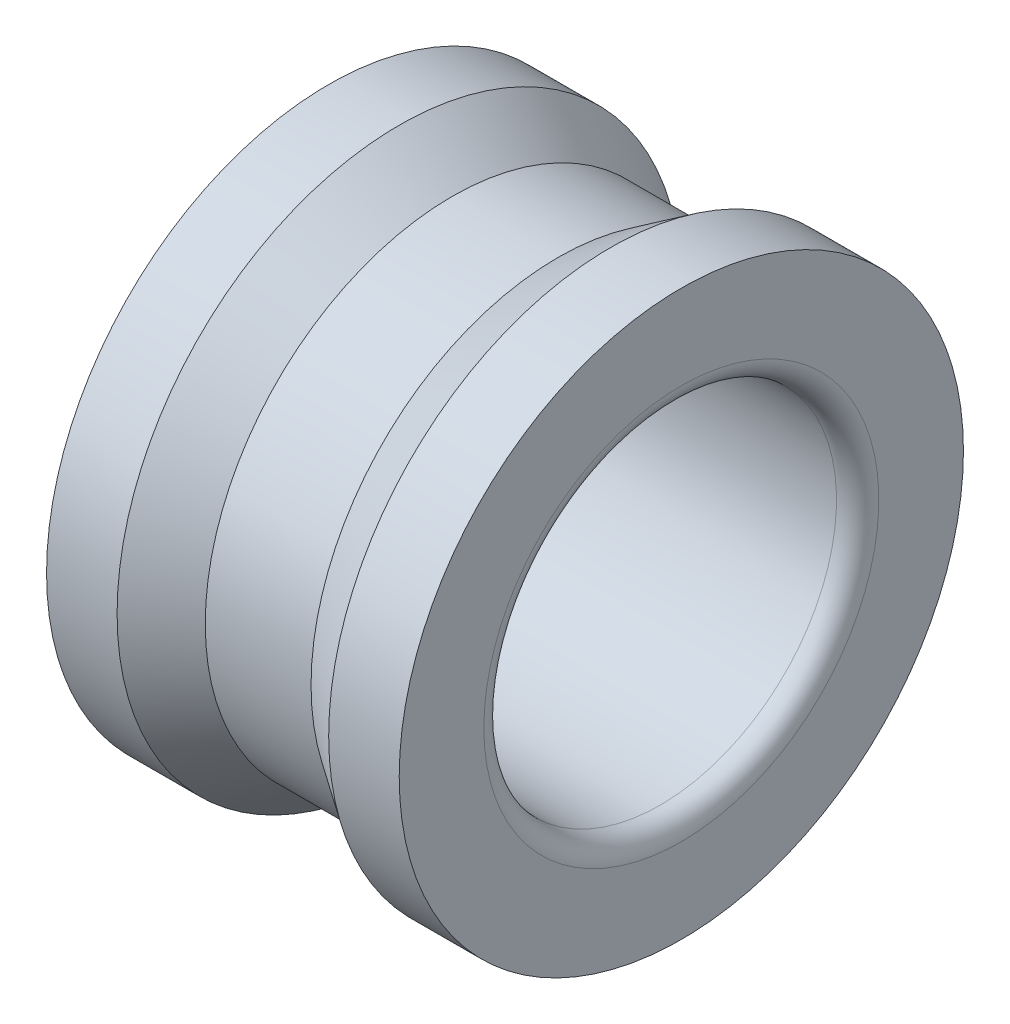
ISO-10303-21;
HEADER;
FILE_DESCRIPTION(('STEP AP214'),'2;1');
FILE_NAME('part.step','',(''),(''),'','','');
FILE_SCHEMA(('AUTOMOTIVE_DESIGN { 1 0 10303 214 1 1 1 1 }'));
ENDSEC;
DATA;
#1=APPLICATION_CONTEXT('core data for automotive mechanical design processes');
#2=APPLICATION_PROTOCOL_DEFINITION('international standard','automotive_design',2000,#1);
#3=PRODUCT_CONTEXT('',#1,'mechanical');
#4=PRODUCT('Part','Part','',(#3));
#5=PRODUCT_RELATED_PRODUCT_CATEGORY('part','',(#4));
#6=PRODUCT_DEFINITION_FORMATION('','',#4);
#7=PRODUCT_DEFINITION_CONTEXT('part definition',#1,'design');
#8=PRODUCT_DEFINITION('design','',#6,#7);
#9=PRODUCT_DEFINITION_SHAPE('','',#8);
#10=(LENGTH_UNIT() NAMED_UNIT(*) SI_UNIT(.MILLI.,.METRE.));
#11=(NAMED_UNIT(*) PLANE_ANGLE_UNIT() SI_UNIT($,.RADIAN.));
#12=(NAMED_UNIT(*) SI_UNIT($,.STERADIAN.) SOLID_ANGLE_UNIT());
#13=UNCERTAINTY_MEASURE_WITH_UNIT(LENGTH_MEASURE(1.E-05),#10,'distance_accuracy_value','');
#14=(GEOMETRIC_REPRESENTATION_CONTEXT(3) GLOBAL_UNCERTAINTY_ASSIGNED_CONTEXT((#13)) GLOBAL_UNIT_ASSIGNED_CONTEXT((#10,
#11,#12)) REPRESENTATION_CONTEXT('',''));
#15=CARTESIAN_POINT('',(0.,0.,0.));
#16=DIRECTION('',(0.,0.,1.));
#17=DIRECTION('',(1.,0.,0.));
#18=AXIS2_PLACEMENT_3D('',#15,#16,#17);
#19=CARTESIAN_POINT('',(-2.5,4.,0.));
#20=DIRECTION('',(1.,0.,0.));
#21=DIRECTION('',(0.,0.,-1.));
#22=AXIS2_PLACEMENT_3D('',#19,#20,#21);
#23=PLANE('',#22);
#24=CARTESIAN_POINT('',(-2.5,0.,0.));
#25=DIRECTION('',(1.,0.,0.));
#26=DIRECTION('',(0.,0.,-1.));
#27=AXIS2_PLACEMENT_3D('',#24,#25,#26);
#28=CIRCLE('',#27,2.8);
#29=CARTESIAN_POINT('',(-2.5,0.,-2.8));
#30=VERTEX_POINT('',#29);
#31=EDGE_CURVE('E50',#30,#30,#28,.T.);
#32=ORIENTED_EDGE('',*,*,#31,.T.);
#33=EDGE_LOOP('',(#32));
#34=FACE_BOUND('',#33,.T.);
#35=CARTESIAN_POINT('',(-2.5,0.,0.));
#36=DIRECTION('',(-1.,0.,0.));
#37=DIRECTION('',(0.,0.,1.));
#38=AXIS2_PLACEMENT_3D('',#35,#36,#37);
#39=CIRCLE('',#38,4.);
#40=CARTESIAN_POINT('',(-2.5,0.,4.));
#41=VERTEX_POINT('',#40);
#42=EDGE_CURVE('E78',#41,#41,#39,.T.);
#43=ORIENTED_EDGE('',*,*,#42,.T.);
#44=EDGE_LOOP('',(#43));
#45=FACE_BOUND('',#44,.T.);
#46=ADVANCED_FACE('F43',(#34,#45),#23,.F.);
#47=CARTESIAN_POINT('',(-2.5,0.,0.));
#48=DIRECTION('',(-1.,0.,0.));
#49=DIRECTION('',(0.,0.,1.));
#50=AXIS2_PLACEMENT_3D('',#47,#48,#49);
#51=CYLINDRICAL_SURFACE('',#50,2.5);
#52=CARTESIAN_POINT('',(-2.2,0.,0.));
#53=DIRECTION('',(1.,0.,0.));
#54=DIRECTION('',(0.,0.,-1.));
#55=AXIS2_PLACEMENT_3D('',#52,#53,#54);
#56=CIRCLE('',#55,2.5);
#57=CARTESIAN_POINT('',(-2.2,0.,-2.5));
#58=VERTEX_POINT('',#57);
#59=EDGE_CURVE('E54',#58,#58,#56,.F.);
#60=ORIENTED_EDGE('',*,*,#59,.T.);
#61=EDGE_LOOP('',(#60));
#62=FACE_BOUND('',#61,.T.);
#63=CARTESIAN_POINT('',(2.2,0.,0.));
#64=DIRECTION('',(-1.,0.,0.));
#65=DIRECTION('',(0.,0.,1.));
#66=AXIS2_PLACEMENT_3D('',#63,#64,#65);
#67=CIRCLE('',#66,2.5);
#68=CARTESIAN_POINT('',(2.2,0.,2.5));
#69=VERTEX_POINT('',#68);
#70=EDGE_CURVE('E58',#69,#69,#67,.F.);
#71=ORIENTED_EDGE('',*,*,#70,.T.);
#72=EDGE_LOOP('',(#71));
#73=FACE_BOUND('',#72,.T.);
#74=ADVANCED_FACE('F116',(#62,#73),#51,.F.);
#75=CARTESIAN_POINT('',(2.5,2.5,0.));
#76=DIRECTION('',(-1.,0.,0.));
#77=DIRECTION('',(0.,0.,1.));
#78=AXIS2_PLACEMENT_3D('',#75,#76,#77);
#79=PLANE('',#78);
#80=CARTESIAN_POINT('',(2.5,0.,0.));
#81=DIRECTION('',(-1.,0.,0.));
#82=DIRECTION('',(0.,0.,1.));
#83=AXIS2_PLACEMENT_3D('',#80,#81,#82);
#84=CIRCLE('',#83,2.8);
#85=CARTESIAN_POINT('',(2.5,0.,2.8));
#86=VERTEX_POINT('',#85);
#87=EDGE_CURVE('E12',#86,#86,#84,.T.);
#88=ORIENTED_EDGE('',*,*,#87,.T.);
#89=EDGE_LOOP('',(#88));
#90=FACE_BOUND('',#89,.T.);
#91=CARTESIAN_POINT('',(2.5,0.,0.));
#92=DIRECTION('',(-1.,0.,0.));
#93=DIRECTION('',(0.,0.,1.));
#94=AXIS2_PLACEMENT_3D('',#91,#92,#93);
#95=CIRCLE('',#94,4.);
#96=CARTESIAN_POINT('',(2.5,0.,4.));
#97=VERTEX_POINT('',#96);
#98=EDGE_CURVE('E63',#97,#97,#95,.T.);
#99=ORIENTED_EDGE('',*,*,#98,.F.);
#100=EDGE_LOOP('',(#99));
#101=FACE_BOUND('',#100,.T.);
#102=ADVANCED_FACE('F111',(#90,#101),#79,.F.);
#103=CARTESIAN_POINT('',(-2.5,0.,0.));
#104=DIRECTION('',(-1.,0.,0.));
#105=DIRECTION('',(0.,0.,1.));
#106=AXIS2_PLACEMENT_3D('',#103,#104,#105);
#107=CYLINDRICAL_SURFACE('',#106,4.);
#108=CARTESIAN_POINT('',(1.5,0.,0.));
#109=DIRECTION('',(-1.,0.,0.));
#110=DIRECTION('',(0.,0.,1.));
#111=AXIS2_PLACEMENT_3D('',#108,#109,#110);
#112=CIRCLE('',#111,4.);
#113=CARTESIAN_POINT('',(1.5,0.,4.));
#114=VERTEX_POINT('',#113);
#115=EDGE_CURVE('E66',#114,#114,#112,.T.);
#116=ORIENTED_EDGE('',*,*,#115,.F.);
#117=EDGE_LOOP('',(#116));
#118=FACE_BOUND('',#117,.T.);
#119=ORIENTED_EDGE('',*,*,#98,.T.);
#120=EDGE_LOOP('',(#119));
#121=FACE_BOUND('',#120,.T.);
#122=ADVANCED_FACE('F105',(#118,#121),#107,.T.);
#123=CARTESIAN_POINT('',(1.5,0.,0.));
#124=DIRECTION('',(1.,0.,0.));
#125=DIRECTION('',(0.,0.,-1.));
#126=AXIS2_PLACEMENT_3D('',#123,#124,#125);
#127=CONICAL_SURFACE('',#126,4.,0.588002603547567);
#128=CARTESIAN_POINT('',(0.75,0.,0.));
#129=DIRECTION('',(-1.,0.,0.));
#130=DIRECTION('',(0.,0.,1.));
#131=AXIS2_PLACEMENT_3D('',#128,#129,#130);
#132=CIRCLE('',#131,3.5);
#133=CARTESIAN_POINT('',(0.75,0.,3.5));
#134=VERTEX_POINT('',#133);
#135=EDGE_CURVE('E69',#134,#134,#132,.T.);
#136=ORIENTED_EDGE('',*,*,#135,.F.);
#137=EDGE_LOOP('',(#136));
#138=FACE_BOUND('',#137,.T.);
#139=ORIENTED_EDGE('',*,*,#115,.T.);
#140=EDGE_LOOP('',(#139));
#141=FACE_BOUND('',#140,.T.);
#142=ADVANCED_FACE('F99',(#138,#141),#127,.T.);
#143=CARTESIAN_POINT('',(-2.5,0.,0.));
#144=DIRECTION('',(-1.,0.,0.));
#145=DIRECTION('',(0.,0.,1.));
#146=AXIS2_PLACEMENT_3D('',#143,#144,#145);
#147=CYLINDRICAL_SURFACE('',#146,3.5);
#148=CARTESIAN_POINT('',(-0.75,0.,0.));
#149=DIRECTION('',(-1.,0.,0.));
#150=DIRECTION('',(0.,0.,1.));
#151=AXIS2_PLACEMENT_3D('',#148,#149,#150);
#152=CIRCLE('',#151,3.5);
#153=CARTESIAN_POINT('',(-0.75,0.,3.5));
#154=VERTEX_POINT('',#153);
#155=EDGE_CURVE('E72',#154,#154,#152,.T.);
#156=ORIENTED_EDGE('',*,*,#155,.F.);
#157=EDGE_LOOP('',(#156));
#158=FACE_BOUND('',#157,.T.);
#159=ORIENTED_EDGE('',*,*,#135,.T.);
#160=EDGE_LOOP('',(#159));
#161=FACE_BOUND('',#160,.T.);
#162=ADVANCED_FACE('F93',(#158,#161),#147,.T.);
#163=CARTESIAN_POINT('',(-0.75,0.,0.));
#164=DIRECTION('',(-1.,0.,0.));
#165=DIRECTION('',(0.,0.,1.));
#166=AXIS2_PLACEMENT_3D('',#163,#164,#165);
#167=CONICAL_SURFACE('',#166,3.5,0.588002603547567);
#168=CARTESIAN_POINT('',(-1.5,0.,0.));
#169=DIRECTION('',(-1.,0.,0.));
#170=DIRECTION('',(0.,0.,1.));
#171=AXIS2_PLACEMENT_3D('',#168,#169,#170);
#172=CIRCLE('',#171,4.);
#173=CARTESIAN_POINT('',(-1.5,0.,4.));
#174=VERTEX_POINT('',#173);
#175=EDGE_CURVE('E75',#174,#174,#172,.T.);
#176=ORIENTED_EDGE('',*,*,#175,.F.);
#177=EDGE_LOOP('',(#176));
#178=FACE_BOUND('',#177,.T.);
#179=ORIENTED_EDGE('',*,*,#155,.T.);
#180=EDGE_LOOP('',(#179));
#181=FACE_BOUND('',#180,.T.);
#182=ADVANCED_FACE('F87',(#178,#181),#167,.T.);
#183=CARTESIAN_POINT('',(-2.5,0.,0.));
#184=DIRECTION('',(-1.,0.,0.));
#185=DIRECTION('',(0.,0.,1.));
#186=AXIS2_PLACEMENT_3D('',#183,#184,#185);
#187=CYLINDRICAL_SURFACE('',#186,4.);
#188=ORIENTED_EDGE('',*,*,#42,.F.);
#189=EDGE_LOOP('',(#188));
#190=FACE_BOUND('',#189,.T.);
#191=ORIENTED_EDGE('',*,*,#175,.T.);
#192=EDGE_LOOP('',(#191));
#193=FACE_BOUND('',#192,.T.);
#194=ADVANCED_FACE('F83',(#190,#193),#187,.T.);
#195=CARTESIAN_POINT('',(-2.2,0.,0.));
#196=DIRECTION('',(1.,0.,0.));
#197=DIRECTION('',(0.,0.,-1.));
#198=AXIS2_PLACEMENT_3D('',#195,#196,#197);
#199=TOROIDAL_SURFACE('',#198,2.8,0.3);
#200=ORIENTED_EDGE('',*,*,#31,.F.);
#201=EDGE_LOOP('',(#200));
#202=FACE_BOUND('',#201,.T.);
#203=ORIENTED_EDGE('',*,*,#59,.F.);
#204=EDGE_LOOP('',(#203));
#205=FACE_BOUND('',#204,.T.);
#206=ADVANCED_FACE('F86',(#202,#205),#199,.T.);
#207=CARTESIAN_POINT('',(2.2,0.,0.));
#208=DIRECTION('',(-1.,0.,0.));
#209=DIRECTION('',(0.,0.,1.));
#210=AXIS2_PLACEMENT_3D('',#207,#208,#209);
#211=TOROIDAL_SURFACE('',#210,2.8,0.3);
#212=ORIENTED_EDGE('',*,*,#70,.F.);
#213=EDGE_LOOP('',(#212));
#214=FACE_BOUND('',#213,.T.);
#215=ORIENTED_EDGE('',*,*,#87,.F.);
#216=EDGE_LOOP('',(#215));
#217=FACE_BOUND('',#216,.T.);
#218=ADVANCED_FACE('F45',(#214,#217),#211,.T.);
#219=CLOSED_SHELL('',(#46,#74,#102,#122,#142,#162,#182,#194,#206,#218));
#220=MANIFOLD_SOLID_BREP('B2',#219);
#221=ADVANCED_BREP_SHAPE_REPRESENTATION('',(#18,#220),#14);
#222=SHAPE_DEFINITION_REPRESENTATION(#9,#221);
ENDSEC;
END-ISO-10303-21;
